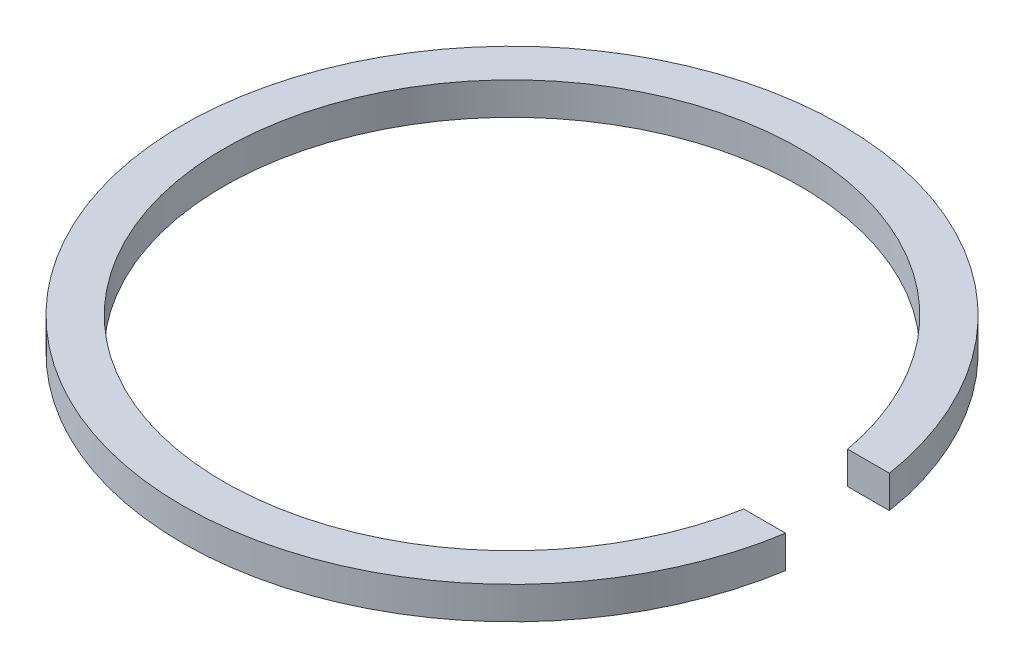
ISO-10303-21;
HEADER;
FILE_DESCRIPTION(('STEP AP214'),'2;1');
FILE_NAME('part.step','',(''),(''),'','','');
FILE_SCHEMA(('AUTOMOTIVE_DESIGN { 1 0 10303 214 1 1 1 1 }'));
ENDSEC;
DATA;
#1=APPLICATION_CONTEXT('core data for automotive mechanical design processes');
#2=APPLICATION_PROTOCOL_DEFINITION('international standard','automotive_design',2000,#1);
#3=PRODUCT_CONTEXT('',#1,'mechanical');
#4=PRODUCT('Part','Part','',(#3));
#5=PRODUCT_RELATED_PRODUCT_CATEGORY('part','',(#4));
#6=PRODUCT_DEFINITION_FORMATION('','',#4);
#7=PRODUCT_DEFINITION_CONTEXT('part definition',#1,'design');
#8=PRODUCT_DEFINITION('design','',#6,#7);
#9=PRODUCT_DEFINITION_SHAPE('','',#8);
#10=(LENGTH_UNIT() NAMED_UNIT(*) SI_UNIT(.MILLI.,.METRE.));
#11=(NAMED_UNIT(*) PLANE_ANGLE_UNIT() SI_UNIT($,.RADIAN.));
#12=(NAMED_UNIT(*) SI_UNIT($,.STERADIAN.) SOLID_ANGLE_UNIT());
#13=UNCERTAINTY_MEASURE_WITH_UNIT(LENGTH_MEASURE(1.E-05),#10,'distance_accuracy_value','');
#14=(GEOMETRIC_REPRESENTATION_CONTEXT(3) GLOBAL_UNCERTAINTY_ASSIGNED_CONTEXT((#13)) GLOBAL_UNIT_ASSIGNED_CONTEXT((#10,
#11,#12)) REPRESENTATION_CONTEXT('',''));
#15=CARTESIAN_POINT('',(0.,0.,0.));
#16=DIRECTION('',(0.,0.,1.));
#17=DIRECTION('',(1.,0.,0.));
#18=AXIS2_PLACEMENT_3D('',#15,#16,#17);
#19=CARTESIAN_POINT('',(0.,1.25,-2.));
#20=DIRECTION('',(0.,0.,-1.));
#21=DIRECTION('',(-1.,0.,0.));
#22=AXIS2_PLACEMENT_3D('',#19,#20,#21);
#23=PLANE('',#22);
#24=DIRECTION('',(1.,0.,0.));
#25=VECTOR('',#24,1.);
#26=CARTESIAN_POINT('',(0.,0.,-2.));
#27=LINE('',#26,#25);
#28=CARTESIAN_POINT('',(10.9310409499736,0.,-2.));
#29=VERTEX_POINT('',#28);
#30=CARTESIAN_POINT('',(12.5415310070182,0.,-2.));
#31=VERTEX_POINT('',#30);
#32=EDGE_CURVE('E98',#29,#31,#27,.T.);
#33=ORIENTED_EDGE('',*,*,#32,.T.);
#34=DIRECTION('',(0.,-1.,0.));
#35=VECTOR('',#34,1.);
#36=CARTESIAN_POINT('',(12.5415310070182,1.25,-2.));
#37=LINE('',#36,#35);
#38=CARTESIAN_POINT('',(12.5415310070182,1.25,-2.));
#39=VERTEX_POINT('',#38);
#40=EDGE_CURVE('E11',#39,#31,#37,.T.);
#41=ORIENTED_EDGE('',*,*,#40,.F.);
#42=DIRECTION('',(1.,0.,0.));
#43=VECTOR('',#42,1.);
#44=CARTESIAN_POINT('',(0.,1.25,-2.));
#45=LINE('',#44,#43);
#46=CARTESIAN_POINT('',(10.9310409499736,1.25,-2.));
#47=VERTEX_POINT('',#46);
#48=EDGE_CURVE('E84',#47,#39,#45,.T.);
#49=ORIENTED_EDGE('',*,*,#48,.F.);
#50=DIRECTION('',(0.,-1.,0.));
#51=VECTOR('',#50,1.);
#52=CARTESIAN_POINT('',(10.9310409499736,1.25,-2.));
#53=LINE('',#52,#51);
#54=EDGE_CURVE('E51',#47,#29,#53,.T.);
#55=ORIENTED_EDGE('',*,*,#54,.T.);
#56=EDGE_LOOP('',(#33,#41,#49,#55));
#57=FACE_BOUND('',#56,.T.);
#58=ADVANCED_FACE('F35',(#57),#23,.F.);
#59=CARTESIAN_POINT('',(0.,1.25,0.));
#60=DIRECTION('',(0.,-1.,0.));
#61=DIRECTION('',(0.,0.,-1.));
#62=AXIS2_PLACEMENT_3D('',#59,#60,#61);
#63=CYLINDRICAL_SURFACE('',#62,12.7);
#64=CARTESIAN_POINT('',(0.,0.,0.));
#65=DIRECTION('',(0.,1.,0.));
#66=DIRECTION('',(0.,0.,1.));
#67=AXIS2_PLACEMENT_3D('',#64,#65,#66);
#68=CIRCLE('',#67,12.7);
#69=CARTESIAN_POINT('',(12.5415310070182,0.,2.));
#70=VERTEX_POINT('',#69);
#71=EDGE_CURVE('E89',#31,#70,#68,.T.);
#72=ORIENTED_EDGE('',*,*,#71,.T.);
#73=DIRECTION('',(0.,-1.,0.));
#74=VECTOR('',#73,1.);
#75=CARTESIAN_POINT('',(12.5415310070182,1.25,2.));
#76=LINE('',#75,#74);
#77=CARTESIAN_POINT('',(12.5415310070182,1.25,2.));
#78=VERTEX_POINT('',#77);
#79=EDGE_CURVE('E43',#78,#70,#76,.T.);
#80=ORIENTED_EDGE('',*,*,#79,.F.);
#81=CARTESIAN_POINT('',(0.,1.25,0.));
#82=DIRECTION('',(0.,1.,0.));
#83=DIRECTION('',(0.,0.,1.));
#84=AXIS2_PLACEMENT_3D('',#81,#82,#83);
#85=CIRCLE('',#84,12.7);
#86=EDGE_CURVE('E76',#39,#78,#85,.T.);
#87=ORIENTED_EDGE('',*,*,#86,.F.);
#88=ORIENTED_EDGE('',*,*,#40,.T.);
#89=EDGE_LOOP('',(#72,#80,#87,#88));
#90=FACE_BOUND('',#89,.T.);
#91=ADVANCED_FACE('F88',(#90),#63,.T.);
#92=CARTESIAN_POINT('',(0.,1.25,2.));
#93=DIRECTION('',(0.,0.,-1.));
#94=DIRECTION('',(-1.,0.,0.));
#95=AXIS2_PLACEMENT_3D('',#92,#93,#94);
#96=PLANE('',#95);
#97=DIRECTION('',(1.,0.,0.));
#98=VECTOR('',#97,1.);
#99=CARTESIAN_POINT('',(0.,0.,2.));
#100=LINE('',#99,#98);
#101=CARTESIAN_POINT('',(10.9310409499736,0.,2.));
#102=VERTEX_POINT('',#101);
#103=EDGE_CURVE('E101',#102,#70,#100,.T.);
#104=ORIENTED_EDGE('',*,*,#103,.F.);
#105=DIRECTION('',(0.,-1.,0.));
#106=VECTOR('',#105,1.);
#107=CARTESIAN_POINT('',(10.9310409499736,1.25,2.));
#108=LINE('',#107,#106);
#109=CARTESIAN_POINT('',(10.9310409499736,1.25,2.));
#110=VERTEX_POINT('',#109);
#111=EDGE_CURVE('E65',#110,#102,#108,.T.);
#112=ORIENTED_EDGE('',*,*,#111,.F.);
#113=DIRECTION('',(1.,0.,0.));
#114=VECTOR('',#113,1.);
#115=CARTESIAN_POINT('',(0.,1.25,2.));
#116=LINE('',#115,#114);
#117=EDGE_CURVE('E83',#110,#78,#116,.T.);
#118=ORIENTED_EDGE('',*,*,#117,.T.);
#119=ORIENTED_EDGE('',*,*,#79,.T.);
#120=EDGE_LOOP('',(#104,#112,#118,#119));
#121=FACE_BOUND('',#120,.T.);
#122=ADVANCED_FACE('F92',(#121),#96,.T.);
#123=CARTESIAN_POINT('',(0.,1.25,0.));
#124=DIRECTION('',(0.,-1.,0.));
#125=DIRECTION('',(0.,0.,-1.));
#126=AXIS2_PLACEMENT_3D('',#123,#124,#125);
#127=CYLINDRICAL_SURFACE('',#126,11.1125);
#128=CARTESIAN_POINT('',(0.,0.,0.));
#129=DIRECTION('',(0.,1.,0.));
#130=DIRECTION('',(0.,0.,1.));
#131=AXIS2_PLACEMENT_3D('',#128,#129,#130);
#132=CIRCLE('',#131,11.1125);
#133=EDGE_CURVE('E103',#29,#102,#132,.T.);
#134=ORIENTED_EDGE('',*,*,#133,.F.);
#135=ORIENTED_EDGE('',*,*,#54,.F.);
#136=CARTESIAN_POINT('',(0.,1.25,0.));
#137=DIRECTION('',(0.,1.,0.));
#138=DIRECTION('',(0.,0.,1.));
#139=AXIS2_PLACEMENT_3D('',#136,#137,#138);
#140=CIRCLE('',#139,11.1125);
#141=EDGE_CURVE('E93',#47,#110,#140,.T.);
#142=ORIENTED_EDGE('',*,*,#141,.T.);
#143=ORIENTED_EDGE('',*,*,#111,.T.);
#144=EDGE_LOOP('',(#134,#135,#142,#143));
#145=FACE_BOUND('',#144,.T.);
#146=ADVANCED_FACE('F109',(#145),#127,.F.);
#147=CARTESIAN_POINT('',(0.,1.25,0.));
#148=DIRECTION('',(0.,1.,0.));
#149=DIRECTION('',(0.,0.,1.));
#150=AXIS2_PLACEMENT_3D('',#147,#148,#149);
#151=PLANE('',#150);
#152=ORIENTED_EDGE('',*,*,#48,.T.);
#153=ORIENTED_EDGE('',*,*,#86,.T.);
#154=ORIENTED_EDGE('',*,*,#117,.F.);
#155=ORIENTED_EDGE('',*,*,#141,.F.);
#156=EDGE_LOOP('',(#152,#153,#154,#155));
#157=FACE_BOUND('',#156,.T.);
#158=ADVANCED_FACE('F80',(#157),#151,.T.);
#159=CARTESIAN_POINT('',(0.,0.,0.));
#160=DIRECTION('',(0.,1.,0.));
#161=DIRECTION('',(0.,0.,1.));
#162=AXIS2_PLACEMENT_3D('',#159,#160,#161);
#163=PLANE('',#162);
#164=ORIENTED_EDGE('',*,*,#32,.F.);
#165=ORIENTED_EDGE('',*,*,#133,.T.);
#166=ORIENTED_EDGE('',*,*,#103,.T.);
#167=ORIENTED_EDGE('',*,*,#71,.F.);
#168=EDGE_LOOP('',(#164,#165,#166,#167));
#169=FACE_BOUND('',#168,.T.);
#170=ADVANCED_FACE('F108',(#169),#163,.F.);
#171=CLOSED_SHELL('',(#58,#91,#122,#146,#158,#170));
#172=MANIFOLD_SOLID_BREP('B2',#171);
#173=ADVANCED_BREP_SHAPE_REPRESENTATION('',(#18,#172),#14);
#174=SHAPE_DEFINITION_REPRESENTATION(#9,#173);
ENDSEC;
END-ISO-10303-21;
